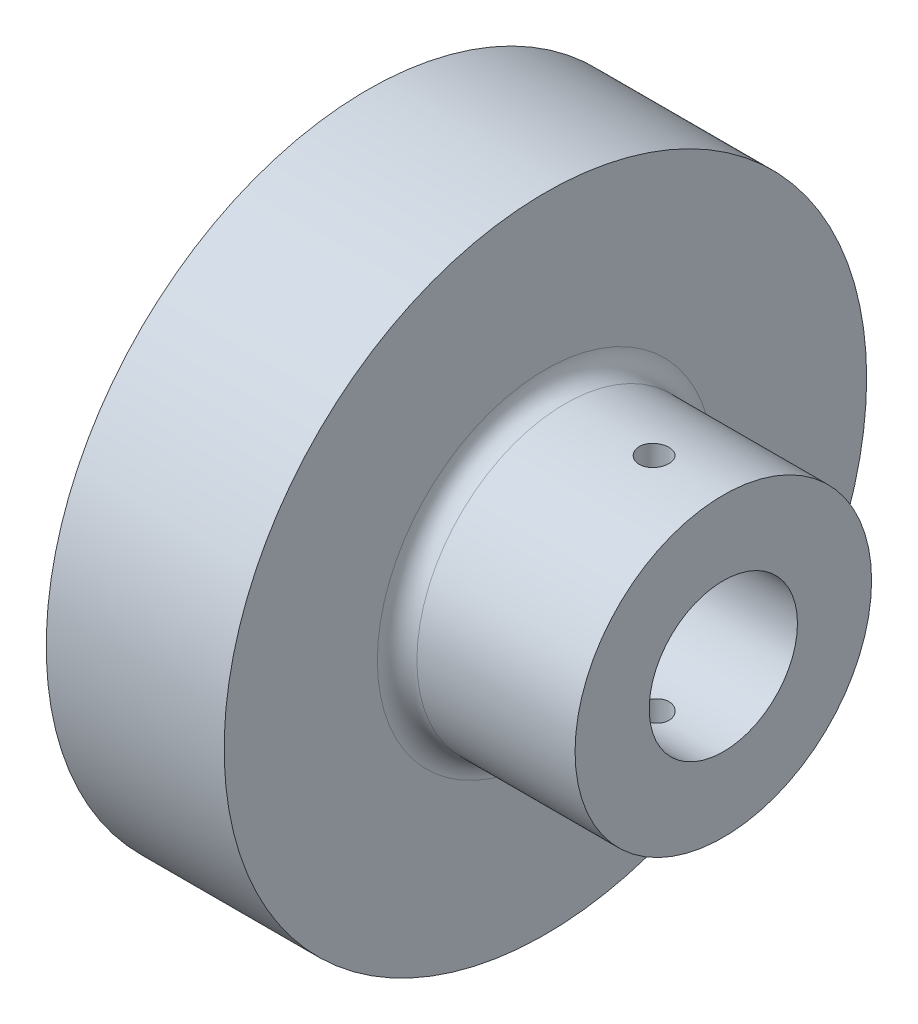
from build123d import *

# Parameters (mm, degrees)
CUT_EXTRUDE1_DEPTH      = 49
CUT_EXTRUDE1_DEPTH_BACK = 47
SKETCH4_R               = 1.5
FILLET1_R               = 2


with BuildPart() as part:
    # Sketch1 → Revolve1 (revolve)
    with BuildSketch(Plane.XY, mode=Mode.PRIVATE) as revolve1_sk:
        Polygon((38.365950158, 7.5), (10.365950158, 7.5), (10.365950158, 27), (2.365950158, 27), (2.365950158, 32.5), (20.365950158, 32.5), (20.365950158, 15), (38.365950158, 15), align=None)
    revolve(revolve1_sk.sketch.rotate(Axis((74.923788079, 0, 0), (-1, 0, 0)), 90), axis=Axis((74.923788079, 0, 0), (-1, 0, 0)))

    # Sketch4 → Cut-Extrude1 (cut, two sides: drawn at the far end of the back side and taken through both)
    with BuildSketch(Plane(origin=(0, 0, 0), x_dir=(1, 0, 0), z_dir=(0, 1, 0)).offset(-CUT_EXTRUDE1_DEPTH_BACK)):
        with Locations(Location((31.365950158, 0, 0), (0, 0, 90))):
            Circle(SKETCH4_R)
    extrude(amount=CUT_EXTRUDE1_DEPTH + CUT_EXTRUDE1_DEPTH_BACK, mode=Mode.SUBTRACT)

    # Fillet1
    fillet1_edges = [part.edges().sort_by_distance(p)[0] for p in [
        (20.365950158, 0, 15),
        (10.365950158, 0, 27),
    ]]
    fillet(fillet1_edges, radius=FILLET1_R)


solid = part.part
